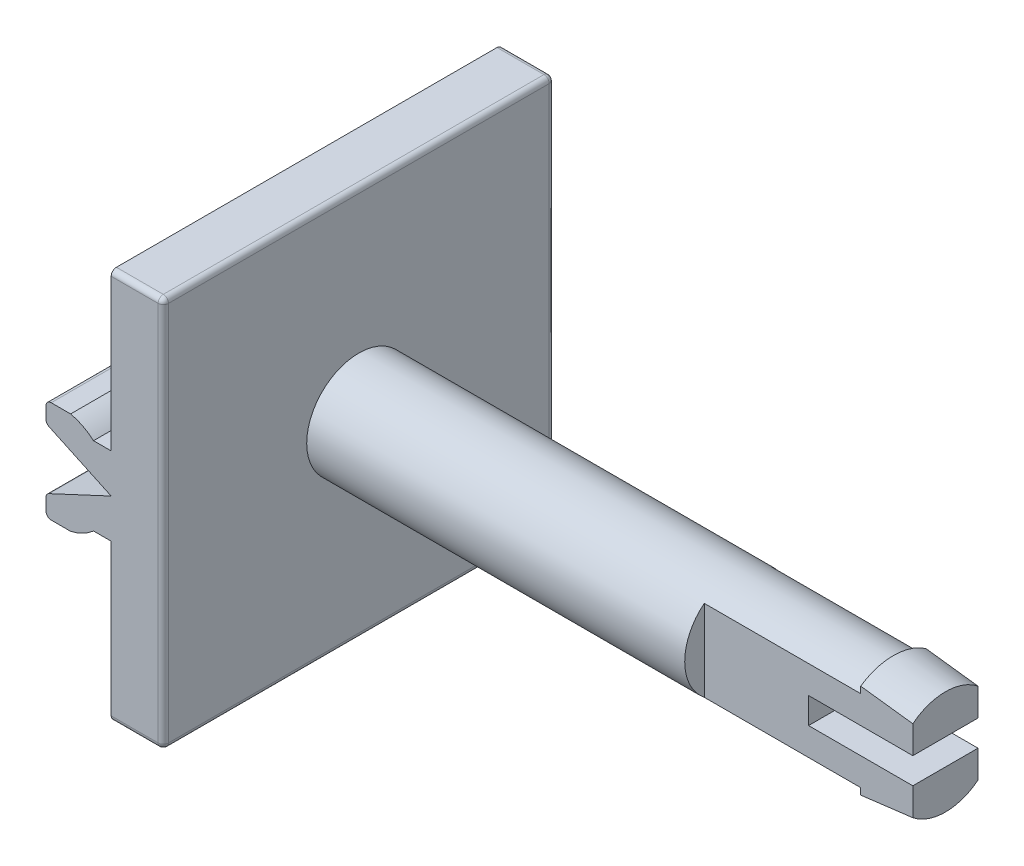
from build123d import *

# Parameters (mm, degrees)
SKETCH_1_W           = 15
SKETCH_1_H           = 15
EXTRUDE_1_DEPTH      = 2
EXTRUDE_2_DEPTH      = 7.5
EXTRUDE_2_DEPTH_BACK = 7.5
SKETCH_3_R           = 2
EXTRUDE_3_DEPTH      = 22.5
CUT_EXTRUDE_1_DEPTH  = 8
CUT_EXTRUDE_2_DEPTH  = 2.5
FILLET_1_R           = 0.2


with BuildPart() as part:
    # Sketch 1 → Extrude 1 (new body)
    with BuildSketch(Plane(origin=(0, 0, 0), x_dir=(0, 0, -1), z_dir=(1, 0, 0))):
        Rectangle(SKETCH_1_W, SKETCH_1_H)
    extrude(amount=EXTRUDE_1_DEPTH)

    # Sketch 2 → Extrude 2 (add, two sides: drawn at the far end of the back side and taken through both)
    with BuildSketch(Plane.XY.offset(-EXTRUDE_2_DEPTH_BACK)):
        with BuildLine():
            Line((-0.677124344, -1.5), (0, -1.5))
            Line((0, -1.5), (0, 0))
            Line((0, 0), (-2.5, -1.165769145))
            Line((-2.5, -1.165769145), (-2.5, -1.95))
            Line((-2.5, -1.95), (-1.555590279, -1.95))
            ThreePointArc((-1.555590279, -1.95), (-1.088161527, -1.780042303), (-0.677124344, -1.5))
        make_face()
        with BuildLine():
            Line((-2.5, 1.165769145), (0, 0))
            Line((0, 0), (0, 1.5))
            Line((0, 1.5), (-0.677124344, 1.5))
            ThreePointArc((-0.677124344, 1.5), (-1.088161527, 1.780042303), (-1.555590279, 1.95))
            Line((-1.555590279, 1.95), (-2.5, 1.95))
            Line((-2.5, 1.95), (-2.5, 1.165769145))
        make_face()
    extrude(amount=EXTRUDE_2_DEPTH + EXTRUDE_2_DEPTH_BACK)

    # Sketch 3 → Extrude 3 (add)
    with BuildSketch(Plane(origin=(2, 0, 0), x_dir=(0, 0, -1), z_dir=(1, 0, 0))):
        with Locations(Location((0, 0, 0), (0, 0, 180))):
            Circle(SKETCH_3_R)
    extrude(amount=EXTRUDE_3_DEPTH)

    # Sketch 4 → Revolve 1 (revolve)
    with BuildSketch(Plane(origin=(0, 0, 0), x_dir=(1, 0, 0), z_dir=(0, 1, 0)), mode=Mode.PRIVATE) as revolve_1_sk:
        Polygon((24.5, 0), (22.5, 0), (22.5, 2.2), (24.5, 2), align=None)
    revolve(revolve_1_sk.sketch.rotate(Axis((24.5, 0, 0), (-1, 0, 0)), 180), axis=Axis((24.5, 0, 0), (-1, 0, 0)))

    # Sketch 5 → Cut-Extrude 1 (cut)
    with BuildSketch(Plane(origin=(24.5, 0, 0), x_dir=(0, 0, -1), z_dir=(1, 0, 0))):
        Polygon((-1.25, 0), (-1.25, 2.5), (-2.25, 2.5), (-2.25, -2.5), (-1.25, -2.5), align=None)
        Polygon((1.25, 0), (1.25, 2.5), (2.25, 2.5), (2.25, -2.5), (1.25, -2.5), align=None)
    extrude(amount=-CUT_EXTRUDE_1_DEPTH, mode=Mode.SUBTRACT)

    # Sketch 6 → Cut-Extrude 2 (cut)
    with BuildSketch(Plane.XY.offset(1.25)):
        Polygon((24.5, 0), (24.5, 0.5), (20.5, 0.5), (20.5, -0.5), (24.5, -0.5), align=None)
    extrude(amount=-CUT_EXTRUDE_2_DEPTH, mode=Mode.SUBTRACT)

    # Fillet 1
    fillet_1_edges = [part.edges().sort_by_distance(p)[0] for p in [
        (1, -7.5, -7.5),
        (1, 7.5, -7.5),
        (1, 7.5, 7.5),
        (1, -7.5, 7.5),
        (2, -7.5, 0),
        (2, 0, -7.5),
        (2, 7.5, 0),
        (-2.5, -1.95, 0),
        (-2.5, -1.165769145, 0),
        (-2.5, 1.165769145, 0),
        (-2.5, 1.95, 0),
        (2, 0, 7.5),
    ]]
    fillet(fillet_1_edges, radius=FILLET_1_R)


solid = part.part
